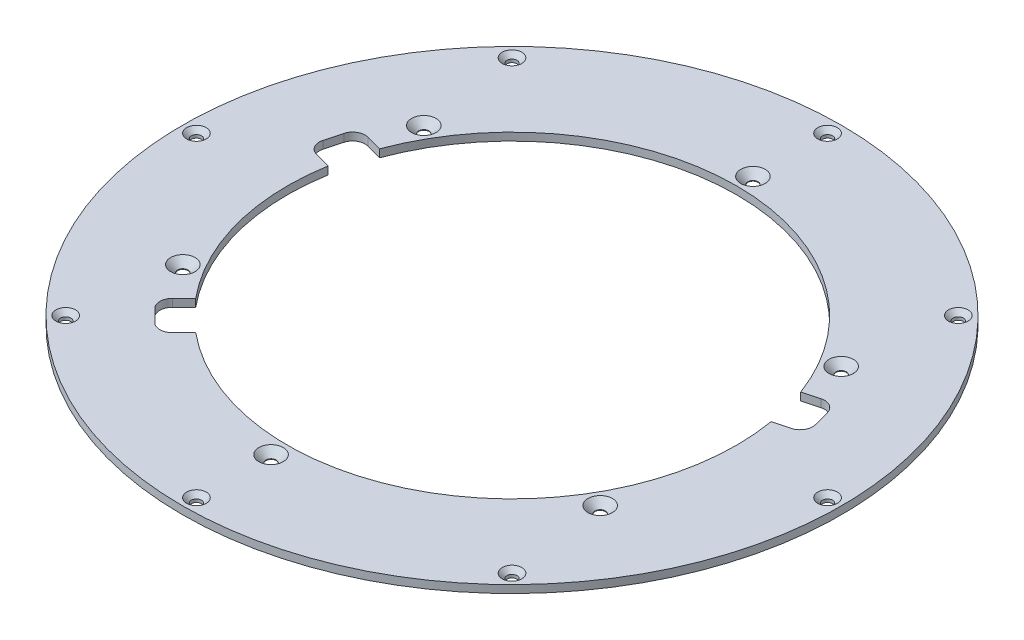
ISO-10303-21;
HEADER;
FILE_DESCRIPTION(('STEP AP214'),'2;1');
FILE_NAME('part.step','',(''),(''),'','','');
FILE_SCHEMA(('AUTOMOTIVE_DESIGN { 1 0 10303 214 1 1 1 1 }'));
ENDSEC;
DATA;
#1=APPLICATION_CONTEXT('core data for automotive mechanical design processes');
#2=APPLICATION_PROTOCOL_DEFINITION('international standard','automotive_design',2000,#1);
#3=PRODUCT_CONTEXT('',#1,'mechanical');
#4=PRODUCT('Part','Part','',(#3));
#5=PRODUCT_RELATED_PRODUCT_CATEGORY('part','',(#4));
#6=PRODUCT_DEFINITION_FORMATION('','',#4);
#7=PRODUCT_DEFINITION_CONTEXT('part definition',#1,'design');
#8=PRODUCT_DEFINITION('design','',#6,#7);
#9=PRODUCT_DEFINITION_SHAPE('','',#8);
#10=(LENGTH_UNIT() NAMED_UNIT(*) SI_UNIT(.MILLI.,.METRE.));
#11=(NAMED_UNIT(*) PLANE_ANGLE_UNIT() SI_UNIT($,.RADIAN.));
#12=(NAMED_UNIT(*) SI_UNIT($,.STERADIAN.) SOLID_ANGLE_UNIT());
#13=UNCERTAINTY_MEASURE_WITH_UNIT(LENGTH_MEASURE(1.E-05),#10,'distance_accuracy_value','');
#14=(GEOMETRIC_REPRESENTATION_CONTEXT(3) GLOBAL_UNCERTAINTY_ASSIGNED_CONTEXT((#13)) GLOBAL_UNIT_ASSIGNED_CONTEXT((#10,
#11,#12)) REPRESENTATION_CONTEXT('',''));
#15=CARTESIAN_POINT('',(0.,0.,0.));
#16=DIRECTION('',(0.,0.,1.));
#17=DIRECTION('',(1.,0.,0.));
#18=AXIS2_PLACEMENT_3D('',#15,#16,#17);
#19=CARTESIAN_POINT('',(0.,3.175,0.));
#20=DIRECTION('',(0.,-1.,0.));
#21=DIRECTION('',(0.,0.,-1.));
#22=AXIS2_PLACEMENT_3D('',#19,#20,#21);
#23=CYLINDRICAL_SURFACE('',#22,91.7575);
#24=DIRECTION('',(0.,-1.,0.));
#25=VECTOR('',#24,1.);
#26=CARTESIAN_POINT('',(-90.4620168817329,3.175,-15.3643193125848));
#27=LINE('',#26,#25);
#28=CARTESIAN_POINT('',(-90.4620168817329,3.175,-15.3643193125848));
#29=VERTEX_POINT('',#28);
#30=CARTESIAN_POINT('',(-90.4620168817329,0.,-15.3643193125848));
#31=VERTEX_POINT('',#30);
#32=EDGE_CURVE('E11',#29,#31,#27,.T.);
#33=ORIENTED_EDGE('',*,*,#32,.F.);
#34=CARTESIAN_POINT('',(0.,3.175,0.));
#35=DIRECTION('',(0.,1.,0.));
#36=DIRECTION('',(0.,0.,1.));
#37=AXIS2_PLACEMENT_3D('',#34,#35,#36);
#38=CIRCLE('',#37,91.7575);
#39=CARTESIAN_POINT('',(-70.6602450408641,3.175,58.5368992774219));
#40=VERTEX_POINT('',#39);
#41=EDGE_CURVE('E413',#29,#40,#38,.T.);
#42=ORIENTED_EDGE('',*,*,#41,.T.);
#43=DIRECTION('',(0.,-1.,0.));
#44=VECTOR('',#43,1.);
#45=CARTESIAN_POINT('',(-70.6602450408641,3.175,58.5368992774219));
#46=LINE('',#45,#44);
#47=CARTESIAN_POINT('',(-70.6602450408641,0.,58.536899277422));
#48=VERTEX_POINT('',#47);
#49=EDGE_CURVE('E428',#48,#40,#46,.F.);
#50=ORIENTED_EDGE('',*,*,#49,.F.);
#51=CARTESIAN_POINT('',(0.,0.,0.));
#52=DIRECTION('',(0.,1.,0.));
#53=DIRECTION('',(0.,0.,1.));
#54=AXIS2_PLACEMENT_3D('',#51,#52,#53);
#55=CIRCLE('',#54,91.7575);
#56=EDGE_CURVE('E187',#31,#48,#55,.T.);
#57=ORIENTED_EDGE('',*,*,#56,.F.);
#58=EDGE_LOOP('',(#33,#42,#50,#57));
#59=FACE_BOUND('',#58,.T.);
#60=ADVANCED_FACE('F41',(#59),#23,.F.);
#61=DIRECTION('',(0.,-1.,0.));
#62=VECTOR('',#61,1.);
#63=CARTESIAN_POINT('',(-58.5368992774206,3.175,70.6602450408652));
#64=LINE('',#63,#62);
#65=CARTESIAN_POINT('',(-58.5368992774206,3.175,70.6602450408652));
#66=VERTEX_POINT('',#65);
#67=CARTESIAN_POINT('',(-58.5368992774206,0.,70.6602450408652));
#68=VERTEX_POINT('',#67);
#69=EDGE_CURVE('E430',#66,#68,#64,.T.);
#70=ORIENTED_EDGE('',*,*,#69,.F.);
#71=CARTESIAN_POINT('',(90.4620168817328,3.175,-15.3643193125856));
#72=VERTEX_POINT('',#71);
#73=EDGE_CURVE('E414',#66,#72,#38,.T.);
#74=ORIENTED_EDGE('',*,*,#73,.T.);
#75=DIRECTION('',(0.,-1.,0.));
#76=VECTOR('',#75,1.);
#77=CARTESIAN_POINT('',(90.4620168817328,3.175,-15.3643193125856));
#78=LINE('',#77,#76);
#79=CARTESIAN_POINT('',(90.4620168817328,0.,-15.3643193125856));
#80=VERTEX_POINT('',#79);
#81=EDGE_CURVE('E421',#80,#72,#78,.F.);
#82=ORIENTED_EDGE('',*,*,#81,.F.);
#83=EDGE_CURVE('E408',#68,#80,#55,.T.);
#84=ORIENTED_EDGE('',*,*,#83,.F.);
#85=EDGE_LOOP('',(#70,#74,#82,#84));
#86=FACE_BOUND('',#85,.T.);
#87=ADVANCED_FACE('F485',(#86),#23,.F.);
#88=CARTESIAN_POINT('',(0.,3.175,0.));
#89=DIRECTION('',(0.,1.,0.));
#90=DIRECTION('',(0.,0.,1.));
#91=AXIS2_PLACEMENT_3D('',#88,#89,#90);
#92=PLANE('',#91);
#93=DIRECTION('',(0.96592582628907,0.,0.258819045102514));
#94=VECTOR('',#93,1.);
#95=CARTESIAN_POINT('',(-2.21872626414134,3.175,8.28039914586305));
#96=LINE('',#95,#94);
#97=CARTESIAN_POINT('',(-96.9832942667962,3.175,-17.1116903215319));
#98=VERTEX_POINT('',#97);
#99=EDGE_CURVE('E215',#98,#29,#96,.T.);
#100=ORIENTED_EDGE('',*,*,#99,.F.);
#101=CARTESIAN_POINT('',(-95.6684935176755,3.175,-22.0185935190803));
#102=DIRECTION('',(0.,1.,0.));
#103=DIRECTION('',(-0.499999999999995,0.,0.866025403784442));
#104=AXIS2_PLACEMENT_3D('',#101,#102,#103);
#105=CIRCLE('',#104,5.08);
#106=CARTESIAN_POINT('',(-100.575396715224,3.175,-23.3333942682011));
#107=VERTEX_POINT('',#106);
#108=EDGE_CURVE('E233',#107,#98,#105,.T.);
#109=ORIENTED_EDGE('',*,*,#108,.F.);
#110=DIRECTION('',(-0.258819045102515,0.,0.96592582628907));
#111=VECTOR('',#110,1.);
#112=CARTESIAN_POINT('',(-100.575396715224,3.175,-23.3333942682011));
#113=LINE('',#112,#111);
#114=CARTESIAN_POINT('',(-98.7675456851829,3.175,-30.0803861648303));
#115=VERTEX_POINT('',#114);
#116=EDGE_CURVE('E230',#115,#107,#113,.T.);
#117=ORIENTED_EDGE('',*,*,#116,.F.);
#118=CARTESIAN_POINT('',(-93.8606424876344,3.175,-28.7655854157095));
#119=DIRECTION('',(0.,1.,0.));
#120=DIRECTION('',(0.499999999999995,0.,-0.866025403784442));
#121=AXIS2_PLACEMENT_3D('',#118,#119,#120);
#122=CIRCLE('',#121,5.08);
#123=CARTESIAN_POINT('',(-92.5458417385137,3.175,-33.672488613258));
#124=VERTEX_POINT('',#123);
#125=EDGE_CURVE('E227',#124,#115,#122,.T.);
#126=ORIENTED_EDGE('',*,*,#125,.F.);
#127=DIRECTION('',(-0.96592582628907,0.,-0.258819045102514));
#128=VECTOR('',#127,1.);
#129=CARTESIAN_POINT('',(2.21872626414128,3.175,-8.28039914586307));
#130=LINE('',#129,#128);
#131=CARTESIAN_POINT('',(-86.0245643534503,3.175,-31.9251176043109));
#132=VERTEX_POINT('',#131);
#133=EDGE_CURVE('E209',#132,#124,#130,.T.);
#134=ORIENTED_EDGE('',*,*,#133,.F.);
#135=CARTESIAN_POINT('',(86.0245643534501,3.175,-31.9251176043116));
#136=VERTEX_POINT('',#135);
#137=EDGE_CURVE('E409',#136,#132,#38,.T.);
#138=ORIENTED_EDGE('',*,*,#137,.F.);
#139=DIRECTION('',(-0.965925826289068,0.,0.258819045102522));
#140=VECTOR('',#139,1.);
#141=CARTESIAN_POINT('',(-2.21872626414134,3.175,-8.28039914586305));
#142=LINE('',#141,#140);
#143=CARTESIAN_POINT('',(92.5458417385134,3.175,-33.6724886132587));
#144=VERTEX_POINT('',#143);
#145=EDGE_CURVE('E250',#144,#136,#142,.T.);
#146=ORIENTED_EDGE('',*,*,#145,.F.);
#147=CARTESIAN_POINT('',(93.8606424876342,3.175,-28.7655854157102));
#148=DIRECTION('',(0.,1.,0.));
#149=DIRECTION('',(0.,0.,-1.));
#150=AXIS2_PLACEMENT_3D('',#147,#148,#149);
#151=CIRCLE('',#150,5.08);
#152=CARTESIAN_POINT('',(98.7675456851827,3.175,-30.080386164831));
#153=VERTEX_POINT('',#152);
#154=EDGE_CURVE('E270',#153,#144,#151,.T.);
#155=ORIENTED_EDGE('',*,*,#154,.F.);
#156=DIRECTION('',(-0.258819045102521,0.,-0.965925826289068));
#157=VECTOR('',#156,1.);
#158=CARTESIAN_POINT('',(98.7675456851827,3.175,-30.080386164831));
#159=LINE('',#158,#157);
#160=CARTESIAN_POINT('',(100.575396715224,3.175,-23.3333942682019));
#161=VERTEX_POINT('',#160);
#162=EDGE_CURVE('E267',#161,#153,#159,.T.);
#163=ORIENTED_EDGE('',*,*,#162,.F.);
#164=CARTESIAN_POINT('',(95.6684935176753,3.175,-22.0185935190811));
#165=DIRECTION('',(0.,1.,0.));
#166=DIRECTION('',(0.,0.,1.));
#167=AXIS2_PLACEMENT_3D('',#164,#165,#166);
#168=CIRCLE('',#167,5.08);
#169=CARTESIAN_POINT('',(96.9832942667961,3.175,-17.1116903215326));
#170=VERTEX_POINT('',#169);
#171=EDGE_CURVE('E264',#170,#161,#168,.T.);
#172=ORIENTED_EDGE('',*,*,#171,.F.);
#173=DIRECTION('',(0.965925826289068,0.,-0.258819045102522));
#174=VECTOR('',#173,1.);
#175=CARTESIAN_POINT('',(2.2187262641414,3.175,8.28039914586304));
#176=LINE('',#175,#174);
#177=EDGE_CURVE('E239',#72,#170,#176,.T.);
#178=ORIENTED_EDGE('',*,*,#177,.F.);
#179=ORIENTED_EDGE('',*,*,#73,.F.);
#180=DIRECTION('',(0.707106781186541,0.,-0.707106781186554));
#181=VECTOR('',#180,1.);
#182=CARTESIAN_POINT('',(6.06167288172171,3.175,6.06167288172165));
#183=LINE('',#182,#181);
#184=CARTESIAN_POINT('',(-63.3108056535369,3.175,75.4341514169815));
#185=VERTEX_POINT('',#184);
#186=EDGE_CURVE('E188',#185,#66,#183,.T.);
#187=ORIENTED_EDGE('',*,*,#186,.F.);
#188=CARTESIAN_POINT('',(-66.9029081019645,3.175,71.8420489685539));
#189=DIRECTION('',(0.,1.,0.));
#190=DIRECTION('',(0.500000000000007,0.,0.866025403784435));
#191=AXIS2_PLACEMENT_3D('',#188,#189,#190);
#192=CIRCLE('',#191,5.08);
#193=CARTESIAN_POINT('',(-70.4950105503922,3.175,75.4341514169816));
#194=VERTEX_POINT('',#193);
#195=EDGE_CURVE('E190',#194,#185,#192,.T.);
#196=ORIENTED_EDGE('',*,*,#195,.F.);
#197=DIRECTION('',(0.707106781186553,0.,0.707106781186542));
#198=VECTOR('',#197,1.);
#199=CARTESIAN_POINT('',(-70.4950105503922,3.175,75.4341514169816));
#200=LINE('',#199,#198);
#201=CARTESIAN_POINT('',(-75.4341514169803,3.175,70.4950105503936));
#202=VERTEX_POINT('',#201);
#203=EDGE_CURVE('E202',#202,#194,#200,.T.);
#204=ORIENTED_EDGE('',*,*,#203,.F.);
#205=CARTESIAN_POINT('',(-71.8420489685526,3.175,66.9029081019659));
#206=DIRECTION('',(0.,1.,0.));
#207=DIRECTION('',(-0.500000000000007,0.,-0.866025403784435));
#208=AXIS2_PLACEMENT_3D('',#205,#206,#207);
#209=CIRCLE('',#208,5.08);
#210=CARTESIAN_POINT('',(-75.4341514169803,3.175,63.3108056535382));
#211=VERTEX_POINT('',#210);
#212=EDGE_CURVE('E200',#211,#202,#209,.T.);
#213=ORIENTED_EDGE('',*,*,#212,.F.);
#214=DIRECTION('',(-0.707106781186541,0.,0.707106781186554));
#215=VECTOR('',#214,1.);
#216=CARTESIAN_POINT('',(-6.06167288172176,3.175,-6.06167288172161));
#217=LINE('',#216,#215);
#218=EDGE_CURVE('E167',#40,#211,#217,.T.);
#219=ORIENTED_EDGE('',*,*,#218,.F.);
#220=ORIENTED_EDGE('',*,*,#41,.F.);
#221=EDGE_LOOP('',(#100,#109,#117,#126,#134,#138,#146,#155,#163,#172,#178,#179,#187,#196,#204,
#213,#219,#220));
#222=FACE_BOUND('',#221,.T.);
#223=CARTESIAN_POINT('',(85.2385503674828,3.175,-49.212500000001));
#224=DIRECTION('',(0.,1.,0.));
#225=DIRECTION('',(-0.866025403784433,0.,0.50000000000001));
#226=AXIS2_PLACEMENT_3D('',#223,#224,#225);
#227=CIRCLE('',#226,5.0038);
#228=CARTESIAN_POINT('',(80.9051324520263,3.175,-46.7106000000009));
#229=VERTEX_POINT('',#228);
#230=EDGE_CURVE('E276',#229,#229,#227,.T.);
#231=ORIENTED_EDGE('',*,*,#230,.F.);
#232=EDGE_LOOP('',(#231));
#233=FACE_BOUND('',#232,.T.);
#234=CARTESIAN_POINT('',(85.2385503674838,3.175,49.2124999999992));
#235=DIRECTION('',(0.,1.,0.));
#236=DIRECTION('',(-0.866025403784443,0.,-0.499999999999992));
#237=AXIS2_PLACEMENT_3D('',#234,#235,#236);
#238=CIRCLE('',#237,5.0038);
#239=CARTESIAN_POINT('',(80.9051324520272,3.175,46.7105999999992));
#240=VERTEX_POINT('',#239);
#241=EDGE_CURVE('E303',#240,#240,#238,.T.);
#242=ORIENTED_EDGE('',*,*,#241,.F.);
#243=EDGE_LOOP('',(#242));
#244=FACE_BOUND('',#243,.T.);
#245=CARTESIAN_POINT('',(0.,3.175,98.425));
#246=DIRECTION('',(0.,1.,0.));
#247=DIRECTION('',(0.,0.,-1.));
#248=AXIS2_PLACEMENT_3D('',#245,#246,#247);
#249=CIRCLE('',#248,5.0038);
#250=CARTESIAN_POINT('',(0.,3.175,93.4212));
#251=VERTEX_POINT('',#250);
#252=EDGE_CURVE('E294',#251,#251,#249,.T.);
#253=ORIENTED_EDGE('',*,*,#252,.F.);
#254=EDGE_LOOP('',(#253));
#255=FACE_BOUND('',#254,.T.);
#256=CARTESIAN_POINT('',(-85.2385503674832,3.175,49.2125000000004));
#257=DIRECTION('',(0.,1.,0.));
#258=DIRECTION('',(0.866025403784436,0.,-0.500000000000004));
#259=AXIS2_PLACEMENT_3D('',#256,#257,#258);
#260=CIRCLE('',#259,5.0038);
#261=CARTESIAN_POINT('',(-80.9051324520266,3.175,46.7106000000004));
#262=VERTEX_POINT('',#261);
#263=EDGE_CURVE('E283',#262,#262,#260,.T.);
#264=ORIENTED_EDGE('',*,*,#263,.F.);
#265=EDGE_LOOP('',(#264));
#266=FACE_BOUND('',#265,.T.);
#267=CARTESIAN_POINT('',(-85.2385503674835,3.175,-49.2124999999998));
#268=DIRECTION('',(0.,1.,0.));
#269=DIRECTION('',(0.86602540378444,0.,0.499999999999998));
#270=AXIS2_PLACEMENT_3D('',#267,#268,#269);
#271=CIRCLE('',#270,5.0038);
#272=CARTESIAN_POINT('',(-80.9051324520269,3.175,-46.7105999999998));
#273=VERTEX_POINT('',#272);
#274=EDGE_CURVE('E293',#273,#273,#271,.T.);
#275=ORIENTED_EDGE('',*,*,#274,.F.);
#276=EDGE_LOOP('',(#275));
#277=FACE_BOUND('',#276,.T.);
#278=CARTESIAN_POINT('',(0.,3.175,-98.425));
#279=DIRECTION('',(0.,1.,0.));
#280=DIRECTION('',(0.,0.,1.));
#281=AXIS2_PLACEMENT_3D('',#278,#279,#280);
#282=CIRCLE('',#281,5.0038);
#283=CARTESIAN_POINT('',(0.,3.175,-93.4212));
#284=VERTEX_POINT('',#283);
#285=EDGE_CURVE('E327',#284,#284,#282,.T.);
#286=ORIENTED_EDGE('',*,*,#285,.F.);
#287=EDGE_LOOP('',(#286));
#288=FACE_BOUND('',#287,.T.);
#289=CARTESIAN_POINT('',(91.1495996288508,3.175,-91.149599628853));
#290=DIRECTION('',(0.,1.,0.));
#291=DIRECTION('',(0.,0.,1.));
#292=AXIS2_PLACEMENT_3D('',#289,#290,#291);
#293=CIRCLE('',#292,4.0005);
#294=CARTESIAN_POINT('',(91.1495996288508,3.175,-87.149099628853));
#295=VERTEX_POINT('',#294);
#296=EDGE_CURVE('E336',#295,#295,#293,.T.);
#297=ORIENTED_EDGE('',*,*,#296,.F.);
#298=EDGE_LOOP('',(#297));
#299=FACE_BOUND('',#298,.T.);
#300=CARTESIAN_POINT('',(128.905,3.175,-1.35020820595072E-12));
#301=DIRECTION('',(0.,1.,0.));
#302=DIRECTION('',(0.,0.,1.));
#303=AXIS2_PLACEMENT_3D('',#300,#301,#302);
#304=CIRCLE('',#303,4.00049999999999);
#305=CARTESIAN_POINT('',(128.905,3.175,4.00049999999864));
#306=VERTEX_POINT('',#305);
#307=EDGE_CURVE('E345',#306,#306,#304,.T.);
#308=ORIENTED_EDGE('',*,*,#307,.F.);
#309=EDGE_LOOP('',(#308));
#310=FACE_BOUND('',#309,.T.);
#311=CARTESIAN_POINT('',(91.1495996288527,3.175,91.1495996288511));
#312=DIRECTION('',(0.,1.,0.));
#313=DIRECTION('',(0.,0.,1.));
#314=AXIS2_PLACEMENT_3D('',#311,#312,#313);
#315=CIRCLE('',#314,4.0005);
#316=CARTESIAN_POINT('',(91.1495996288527,3.175,95.1500996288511));
#317=VERTEX_POINT('',#316);
#318=EDGE_CURVE('E354',#317,#317,#315,.T.);
#319=ORIENTED_EDGE('',*,*,#318,.F.);
#320=EDGE_LOOP('',(#319));
#321=FACE_BOUND('',#320,.T.);
#322=CARTESIAN_POINT('',(0.,3.175,128.905));
#323=DIRECTION('',(0.,1.,0.));
#324=DIRECTION('',(0.,0.,1.));
#325=AXIS2_PLACEMENT_3D('',#322,#323,#324);
#326=CIRCLE('',#325,4.0005);
#327=CARTESIAN_POINT('',(0.,3.175,132.9055));
#328=VERTEX_POINT('',#327);
#329=EDGE_CURVE('E363',#328,#328,#326,.T.);
#330=ORIENTED_EDGE('',*,*,#329,.F.);
#331=EDGE_LOOP('',(#330));
#332=FACE_BOUND('',#331,.T.);
#333=CARTESIAN_POINT('',(-91.1495996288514,3.175,91.1495996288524));
#334=DIRECTION('',(0.,1.,0.));
#335=DIRECTION('',(0.,0.,1.));
#336=AXIS2_PLACEMENT_3D('',#333,#334,#335);
#337=CIRCLE('',#336,4.0005);
#338=CARTESIAN_POINT('',(-91.1495996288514,3.175,95.1500996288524));
#339=VERTEX_POINT('',#338);
#340=EDGE_CURVE('E372',#339,#339,#337,.T.);
#341=ORIENTED_EDGE('',*,*,#340,.F.);
#342=EDGE_LOOP('',(#341));
#343=FACE_BOUND('',#342,.T.);
#344=CARTESIAN_POINT('',(-128.905,3.175,4.50069401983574E-13));
#345=DIRECTION('',(0.,1.,0.));
#346=DIRECTION('',(0.,0.,1.));
#347=AXIS2_PLACEMENT_3D('',#344,#345,#346);
#348=CIRCLE('',#347,4.0005);
#349=CARTESIAN_POINT('',(-128.905,3.175,4.00050000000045));
#350=VERTEX_POINT('',#349);
#351=EDGE_CURVE('E381',#350,#350,#348,.T.);
#352=ORIENTED_EDGE('',*,*,#351,.F.);
#353=EDGE_LOOP('',(#352));
#354=FACE_BOUND('',#353,.T.);
#355=CARTESIAN_POINT('',(-91.1495996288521,3.175,-91.1495996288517));
#356=DIRECTION('',(0.,1.,0.));
#357=DIRECTION('',(0.,0.,1.));
#358=AXIS2_PLACEMENT_3D('',#355,#356,#357);
#359=CIRCLE('',#358,4.0005);
#360=CARTESIAN_POINT('',(-91.1495996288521,3.175,-87.1490996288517));
#361=VERTEX_POINT('',#360);
#362=EDGE_CURVE('E390',#361,#361,#359,.T.);
#363=ORIENTED_EDGE('',*,*,#362,.F.);
#364=EDGE_LOOP('',(#363));
#365=FACE_BOUND('',#364,.T.);
#366=CARTESIAN_POINT('',(0.,3.175,-128.905));
#367=DIRECTION('',(0.,1.,0.));
#368=DIRECTION('',(0.,0.,1.));
#369=AXIS2_PLACEMENT_3D('',#366,#367,#368);
#370=CIRCLE('',#369,4.0005);
#371=CARTESIAN_POINT('',(0.,3.175,-124.9045));
#372=VERTEX_POINT('',#371);
#373=EDGE_CURVE('E399',#372,#372,#370,.T.);
#374=ORIENTED_EDGE('',*,*,#373,.F.);
#375=EDGE_LOOP('',(#374));
#376=FACE_BOUND('',#375,.T.);
#377=CARTESIAN_POINT('',(0.,3.175,0.));
#378=DIRECTION('',(0.,1.,0.));
#379=DIRECTION('',(0.,0.,1.));
#380=AXIS2_PLACEMENT_3D('',#377,#378,#379);
#381=CIRCLE('',#380,134.62);
#382=CARTESIAN_POINT('',(0.,3.175,134.62));
#383=VERTEX_POINT('',#382);
#384=EDGE_CURVE('E418',#383,#383,#381,.T.);
#385=ORIENTED_EDGE('',*,*,#384,.T.);
#386=EDGE_LOOP('',(#385));
#387=FACE_BOUND('',#386,.T.);
#388=ADVANCED_FACE('F439',(#222,#233,#244,#255,#266,#277,#288,#299,#310,#321,#332,#343,#354,
#365,#376,#387),#92,.T.);
#389=CARTESIAN_POINT('',(0.,0.,0.));
#390=DIRECTION('',(0.,1.,0.));
#391=DIRECTION('',(0.,0.,1.));
#392=AXIS2_PLACEMENT_3D('',#389,#390,#391);
#393=PLANE('',#392);
#394=CARTESIAN_POINT('',(85.2385503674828,0.,-49.212500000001));
#395=DIRECTION('',(0.,1.,0.));
#396=DIRECTION('',(-0.866025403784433,0.,0.50000000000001));
#397=AXIS2_PLACEMENT_3D('',#394,#395,#396);
#398=CIRCLE('',#397,2.08279999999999);
#399=CARTESIAN_POINT('',(83.4347926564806,0.,-48.171100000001));
#400=VERTEX_POINT('',#399);
#401=EDGE_CURVE('E314',#400,#400,#398,.T.);
#402=ORIENTED_EDGE('',*,*,#401,.T.);
#403=EDGE_LOOP('',(#402));
#404=FACE_BOUND('',#403,.T.);
#405=CARTESIAN_POINT('',(85.2385503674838,0.,49.2124999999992));
#406=DIRECTION('',(0.,1.,0.));
#407=DIRECTION('',(-0.866025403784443,0.,-0.499999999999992));
#408=AXIS2_PLACEMENT_3D('',#405,#406,#407);
#409=CIRCLE('',#408,2.08279999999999);
#410=CARTESIAN_POINT('',(83.4347926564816,0.,48.1710999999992));
#411=VERTEX_POINT('',#410);
#412=EDGE_CURVE('E306',#411,#411,#409,.T.);
#413=ORIENTED_EDGE('',*,*,#412,.T.);
#414=EDGE_LOOP('',(#413));
#415=FACE_BOUND('',#414,.T.);
#416=CARTESIAN_POINT('',(0.,0.,98.425));
#417=DIRECTION('',(0.,1.,0.));
#418=DIRECTION('',(0.,0.,-1.));
#419=AXIS2_PLACEMENT_3D('',#416,#417,#418);
#420=CIRCLE('',#419,2.08279999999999);
#421=CARTESIAN_POINT('',(0.,0.,96.3422));
#422=VERTEX_POINT('',#421);
#423=EDGE_CURVE('E297',#422,#422,#420,.T.);
#424=ORIENTED_EDGE('',*,*,#423,.T.);
#425=EDGE_LOOP('',(#424));
#426=FACE_BOUND('',#425,.T.);
#427=CARTESIAN_POINT('',(-85.2385503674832,0.,49.2125000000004));
#428=DIRECTION('',(0.,1.,0.));
#429=DIRECTION('',(0.866025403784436,0.,-0.500000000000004));
#430=AXIS2_PLACEMENT_3D('',#427,#428,#429);
#431=CIRCLE('',#430,2.08279999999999);
#432=CARTESIAN_POINT('',(-83.434792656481,0.,48.1711000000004));
#433=VERTEX_POINT('',#432);
#434=EDGE_CURVE('E286',#433,#433,#431,.T.);
#435=ORIENTED_EDGE('',*,*,#434,.T.);
#436=EDGE_LOOP('',(#435));
#437=FACE_BOUND('',#436,.T.);
#438=CARTESIAN_POINT('',(-85.2385503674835,0.,-49.2124999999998));
#439=DIRECTION('',(0.,1.,0.));
#440=DIRECTION('',(0.86602540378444,0.,0.499999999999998));
#441=AXIS2_PLACEMENT_3D('',#438,#439,#440);
#442=CIRCLE('',#441,2.08279999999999);
#443=CARTESIAN_POINT('',(-83.4347926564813,0.,-48.1710999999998));
#444=VERTEX_POINT('',#443);
#445=EDGE_CURVE('E321',#444,#444,#442,.T.);
#446=ORIENTED_EDGE('',*,*,#445,.T.);
#447=EDGE_LOOP('',(#446));
#448=FACE_BOUND('',#447,.T.);
#449=CARTESIAN_POINT('',(0.,0.,-98.425));
#450=DIRECTION('',(0.,1.,0.));
#451=DIRECTION('',(0.,0.,1.));
#452=AXIS2_PLACEMENT_3D('',#449,#450,#451);
#453=CIRCLE('',#452,2.08279999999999);
#454=CARTESIAN_POINT('',(0.,0.,-96.3422));
#455=VERTEX_POINT('',#454);
#456=EDGE_CURVE('E333',#455,#455,#453,.T.);
#457=ORIENTED_EDGE('',*,*,#456,.T.);
#458=EDGE_LOOP('',(#457));
#459=FACE_BOUND('',#458,.T.);
#460=CARTESIAN_POINT('',(91.1495996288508,0.,-91.149599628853));
#461=DIRECTION('',(0.,1.,0.));
#462=DIRECTION('',(0.,0.,1.));
#463=AXIS2_PLACEMENT_3D('',#460,#461,#462);
#464=CIRCLE('',#463,2.0828);
#465=CARTESIAN_POINT('',(91.1495996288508,0.,-89.066799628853));
#466=VERTEX_POINT('',#465);
#467=EDGE_CURVE('E342',#466,#466,#464,.T.);
#468=ORIENTED_EDGE('',*,*,#467,.T.);
#469=EDGE_LOOP('',(#468));
#470=FACE_BOUND('',#469,.T.);
#471=CARTESIAN_POINT('',(128.905,0.,-1.35020820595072E-12));
#472=DIRECTION('',(0.,1.,0.));
#473=DIRECTION('',(0.,0.,1.));
#474=AXIS2_PLACEMENT_3D('',#471,#472,#473);
#475=CIRCLE('',#474,2.0828);
#476=CARTESIAN_POINT('',(128.905,0.,2.08279999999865));
#477=VERTEX_POINT('',#476);
#478=EDGE_CURVE('E351',#477,#477,#475,.T.);
#479=ORIENTED_EDGE('',*,*,#478,.T.);
#480=EDGE_LOOP('',(#479));
#481=FACE_BOUND('',#480,.T.);
#482=CARTESIAN_POINT('',(91.1495996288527,0.,91.1495996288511));
#483=DIRECTION('',(0.,1.,0.));
#484=DIRECTION('',(0.,0.,1.));
#485=AXIS2_PLACEMENT_3D('',#482,#483,#484);
#486=CIRCLE('',#485,2.0828);
#487=CARTESIAN_POINT('',(91.1495996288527,0.,93.2323996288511));
#488=VERTEX_POINT('',#487);
#489=EDGE_CURVE('E360',#488,#488,#486,.T.);
#490=ORIENTED_EDGE('',*,*,#489,.T.);
#491=EDGE_LOOP('',(#490));
#492=FACE_BOUND('',#491,.T.);
#493=CARTESIAN_POINT('',(0.,0.,128.905));
#494=DIRECTION('',(0.,1.,0.));
#495=DIRECTION('',(0.,0.,1.));
#496=AXIS2_PLACEMENT_3D('',#493,#494,#495);
#497=CIRCLE('',#496,2.0828);
#498=CARTESIAN_POINT('',(0.,0.,130.9878));
#499=VERTEX_POINT('',#498);
#500=EDGE_CURVE('E369',#499,#499,#497,.T.);
#501=ORIENTED_EDGE('',*,*,#500,.T.);
#502=EDGE_LOOP('',(#501));
#503=FACE_BOUND('',#502,.T.);
#504=CARTESIAN_POINT('',(-91.1495996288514,0.,91.1495996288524));
#505=DIRECTION('',(0.,1.,0.));
#506=DIRECTION('',(0.,0.,1.));
#507=AXIS2_PLACEMENT_3D('',#504,#505,#506);
#508=CIRCLE('',#507,2.0828);
#509=CARTESIAN_POINT('',(-91.1495996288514,0.,93.2323996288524));
#510=VERTEX_POINT('',#509);
#511=EDGE_CURVE('E378',#510,#510,#508,.T.);
#512=ORIENTED_EDGE('',*,*,#511,.T.);
#513=EDGE_LOOP('',(#512));
#514=FACE_BOUND('',#513,.T.);
#515=CARTESIAN_POINT('',(-128.905,0.,4.50069401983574E-13));
#516=DIRECTION('',(0.,1.,0.));
#517=DIRECTION('',(0.,0.,1.));
#518=AXIS2_PLACEMENT_3D('',#515,#516,#517);
#519=CIRCLE('',#518,2.0828);
#520=CARTESIAN_POINT('',(-128.905,0.,2.08280000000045));
#521=VERTEX_POINT('',#520);
#522=EDGE_CURVE('E387',#521,#521,#519,.T.);
#523=ORIENTED_EDGE('',*,*,#522,.T.);
#524=EDGE_LOOP('',(#523));
#525=FACE_BOUND('',#524,.T.);
#526=CARTESIAN_POINT('',(-91.1495996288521,0.,-91.1495996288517));
#527=DIRECTION('',(0.,1.,0.));
#528=DIRECTION('',(0.,0.,1.));
#529=AXIS2_PLACEMENT_3D('',#526,#527,#528);
#530=CIRCLE('',#529,2.0828);
#531=CARTESIAN_POINT('',(-91.1495996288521,0.,-89.0667996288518));
#532=VERTEX_POINT('',#531);
#533=EDGE_CURVE('E396',#532,#532,#530,.T.);
#534=ORIENTED_EDGE('',*,*,#533,.T.);
#535=EDGE_LOOP('',(#534));
#536=FACE_BOUND('',#535,.T.);
#537=CARTESIAN_POINT('',(0.,0.,-128.905));
#538=DIRECTION('',(0.,1.,0.));
#539=DIRECTION('',(0.,0.,1.));
#540=AXIS2_PLACEMENT_3D('',#537,#538,#539);
#541=CIRCLE('',#540,2.0828);
#542=CARTESIAN_POINT('',(0.,0.,-126.8222));
#543=VERTEX_POINT('',#542);
#544=EDGE_CURVE('E405',#543,#543,#541,.T.);
#545=ORIENTED_EDGE('',*,*,#544,.T.);
#546=EDGE_LOOP('',(#545));
#547=FACE_BOUND('',#546,.T.);
#548=CARTESIAN_POINT('',(0.,0.,0.));
#549=DIRECTION('',(0.,1.,0.));
#550=DIRECTION('',(0.,0.,1.));
#551=AXIS2_PLACEMENT_3D('',#548,#549,#550);
#552=CIRCLE('',#551,134.62);
#553=CARTESIAN_POINT('',(0.,0.,134.62));
#554=VERTEX_POINT('',#553);
#555=EDGE_CURVE('E412',#554,#554,#552,.T.);
#556=ORIENTED_EDGE('',*,*,#555,.F.);
#557=EDGE_LOOP('',(#556));
#558=FACE_BOUND('',#557,.T.);
#559=CARTESIAN_POINT('',(-95.6684935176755,0.,-22.0185935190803));
#560=DIRECTION('',(0.,1.,0.));
#561=DIRECTION('',(-0.499999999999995,0.,0.866025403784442));
#562=AXIS2_PLACEMENT_3D('',#559,#560,#561);
#563=CIRCLE('',#562,5.08);
#564=CARTESIAN_POINT('',(-100.575396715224,0.,-23.3333942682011));
#565=VERTEX_POINT('',#564);
#566=CARTESIAN_POINT('',(-96.9832942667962,0.,-17.1116903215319));
#567=VERTEX_POINT('',#566);
#568=EDGE_CURVE('E221',#565,#567,#563,.T.);
#569=ORIENTED_EDGE('',*,*,#568,.T.);
#570=DIRECTION('',(0.96592582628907,0.,0.258819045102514));
#571=VECTOR('',#570,1.);
#572=CARTESIAN_POINT('',(-2.21872626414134,0.,8.28039914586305));
#573=LINE('',#572,#571);
#574=EDGE_CURVE('E223',#567,#31,#573,.T.);
#575=ORIENTED_EDGE('',*,*,#574,.T.);
#576=ORIENTED_EDGE('',*,*,#56,.T.);
#577=DIRECTION('',(-0.707106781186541,0.,0.707106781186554));
#578=VECTOR('',#577,1.);
#579=CARTESIAN_POINT('',(-6.06167288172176,0.,-6.06167288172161));
#580=LINE('',#579,#578);
#581=CARTESIAN_POINT('',(-75.4341514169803,0.,63.3108056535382));
#582=VERTEX_POINT('',#581);
#583=EDGE_CURVE('E56',#48,#582,#580,.T.);
#584=ORIENTED_EDGE('',*,*,#583,.T.);
#585=CARTESIAN_POINT('',(-71.8420489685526,0.,66.9029081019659));
#586=DIRECTION('',(0.,1.,0.));
#587=DIRECTION('',(-0.500000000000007,0.,-0.866025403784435));
#588=AXIS2_PLACEMENT_3D('',#585,#586,#587);
#589=CIRCLE('',#588,5.08);
#590=CARTESIAN_POINT('',(-75.4341514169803,0.,70.4950105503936));
#591=VERTEX_POINT('',#590);
#592=EDGE_CURVE('E175',#582,#591,#589,.T.);
#593=ORIENTED_EDGE('',*,*,#592,.T.);
#594=DIRECTION('',(0.707106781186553,0.,0.707106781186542));
#595=VECTOR('',#594,1.);
#596=CARTESIAN_POINT('',(-70.4950105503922,0.,75.4341514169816));
#597=LINE('',#596,#595);
#598=CARTESIAN_POINT('',(-70.4950105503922,0.,75.4341514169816));
#599=VERTEX_POINT('',#598);
#600=EDGE_CURVE('E180',#591,#599,#597,.T.);
#601=ORIENTED_EDGE('',*,*,#600,.T.);
#602=CARTESIAN_POINT('',(-66.9029081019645,0.,71.8420489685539));
#603=DIRECTION('',(0.,1.,0.));
#604=DIRECTION('',(0.500000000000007,0.,0.866025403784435));
#605=AXIS2_PLACEMENT_3D('',#602,#603,#604);
#606=CIRCLE('',#605,5.08);
#607=CARTESIAN_POINT('',(-63.3108056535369,0.,75.4341514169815));
#608=VERTEX_POINT('',#607);
#609=EDGE_CURVE('E194',#599,#608,#606,.T.);
#610=ORIENTED_EDGE('',*,*,#609,.T.);
#611=DIRECTION('',(0.707106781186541,0.,-0.707106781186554));
#612=VECTOR('',#611,1.);
#613=CARTESIAN_POINT('',(6.06167288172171,0.,6.06167288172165));
#614=LINE('',#613,#612);
#615=EDGE_CURVE('E172',#608,#68,#614,.T.);
#616=ORIENTED_EDGE('',*,*,#615,.T.);
#617=ORIENTED_EDGE('',*,*,#83,.T.);
#618=DIRECTION('',(0.965925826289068,0.,-0.258819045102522));
#619=VECTOR('',#618,1.);
#620=CARTESIAN_POINT('',(2.2187262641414,0.,8.28039914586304));
#621=LINE('',#620,#619);
#622=CARTESIAN_POINT('',(96.9832942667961,0.,-17.1116903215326));
#623=VERTEX_POINT('',#622);
#624=EDGE_CURVE('E246',#80,#623,#621,.T.);
#625=ORIENTED_EDGE('',*,*,#624,.T.);
#626=CARTESIAN_POINT('',(95.6684935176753,0.,-22.0185935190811));
#627=DIRECTION('',(0.,1.,0.));
#628=DIRECTION('',(0.,0.,1.));
#629=AXIS2_PLACEMENT_3D('',#626,#627,#628);
#630=CIRCLE('',#629,5.08);
#631=CARTESIAN_POINT('',(100.575396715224,0.,-23.3333942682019));
#632=VERTEX_POINT('',#631);
#633=EDGE_CURVE('E249',#623,#632,#630,.T.);
#634=ORIENTED_EDGE('',*,*,#633,.T.);
#635=DIRECTION('',(-0.258819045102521,0.,-0.965925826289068));
#636=VECTOR('',#635,1.);
#637=CARTESIAN_POINT('',(98.7675456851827,0.,-30.080386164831));
#638=LINE('',#637,#636);
#639=CARTESIAN_POINT('',(98.7675456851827,0.,-30.080386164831));
#640=VERTEX_POINT('',#639);
#641=EDGE_CURVE('E253',#632,#640,#638,.T.);
#642=ORIENTED_EDGE('',*,*,#641,.T.);
#643=CARTESIAN_POINT('',(93.8606424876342,0.,-28.7655854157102));
#644=DIRECTION('',(0.,1.,0.));
#645=DIRECTION('',(0.,0.,-1.));
#646=AXIS2_PLACEMENT_3D('',#643,#644,#645);
#647=CIRCLE('',#646,5.08);
#648=CARTESIAN_POINT('',(92.5458417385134,0.,-33.6724886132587));
#649=VERTEX_POINT('',#648);
#650=EDGE_CURVE('E256',#640,#649,#647,.T.);
#651=ORIENTED_EDGE('',*,*,#650,.T.);
#652=DIRECTION('',(-0.965925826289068,0.,0.258819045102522));
#653=VECTOR('',#652,1.);
#654=CARTESIAN_POINT('',(-2.21872626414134,0.,-8.28039914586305));
#655=LINE('',#654,#653);
#656=CARTESIAN_POINT('',(86.0245643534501,0.,-31.9251176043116));
#657=VERTEX_POINT('',#656);
#658=EDGE_CURVE('E259',#649,#657,#655,.T.);
#659=ORIENTED_EDGE('',*,*,#658,.T.);
#660=CARTESIAN_POINT('',(-86.0245643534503,0.,-31.9251176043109));
#661=VERTEX_POINT('',#660);
#662=EDGE_CURVE('E415',#657,#661,#55,.T.);
#663=ORIENTED_EDGE('',*,*,#662,.T.);
#664=DIRECTION('',(-0.96592582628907,0.,-0.258819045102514));
#665=VECTOR('',#664,1.);
#666=CARTESIAN_POINT('',(2.21872626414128,0.,-8.28039914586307));
#667=LINE('',#666,#665);
#668=CARTESIAN_POINT('',(-92.5458417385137,0.,-33.672488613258));
#669=VERTEX_POINT('',#668);
#670=EDGE_CURVE('E64',#661,#669,#667,.T.);
#671=ORIENTED_EDGE('',*,*,#670,.T.);
#672=CARTESIAN_POINT('',(-93.8606424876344,0.,-28.7655854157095));
#673=DIRECTION('',(0.,1.,0.));
#674=DIRECTION('',(0.499999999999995,0.,-0.866025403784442));
#675=AXIS2_PLACEMENT_3D('',#672,#673,#674);
#676=CIRCLE('',#675,5.08);
#677=CARTESIAN_POINT('',(-98.7675456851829,0.,-30.0803861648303));
#678=VERTEX_POINT('',#677);
#679=EDGE_CURVE('E214',#669,#678,#676,.T.);
#680=ORIENTED_EDGE('',*,*,#679,.T.);
#681=DIRECTION('',(-0.258819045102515,0.,0.96592582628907));
#682=VECTOR('',#681,1.);
#683=CARTESIAN_POINT('',(-100.575396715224,0.,-23.3333942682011));
#684=LINE('',#683,#682);
#685=EDGE_CURVE('E218',#678,#565,#684,.T.);
#686=ORIENTED_EDGE('',*,*,#685,.T.);
#687=EDGE_LOOP('',(#569,#575,#576,#584,#593,#601,#610,#616,#617,#625,#634,#642,#651,#659,#663,
#671,#680,#686));
#688=FACE_BOUND('',#687,.T.);
#689=ADVANCED_FACE('F184',(#404,#415,#426,#437,#448,#459,#470,#481,#492,#503,#514,#525,#536,
#547,#558,#688),#393,.F.);
#690=CARTESIAN_POINT('',(0.,3.175,0.));
#691=DIRECTION('',(0.,-1.,0.));
#692=DIRECTION('',(0.,0.,-1.));
#693=AXIS2_PLACEMENT_3D('',#690,#691,#692);
#694=CYLINDRICAL_SURFACE('',#693,134.62);
#695=ORIENTED_EDGE('',*,*,#384,.F.);
#696=EDGE_LOOP('',(#695));
#697=FACE_BOUND('',#696,.T.);
#698=ORIENTED_EDGE('',*,*,#555,.T.);
#699=EDGE_LOOP('',(#698));
#700=FACE_BOUND('',#699,.T.);
#701=ADVANCED_FACE('F43',(#697,#700),#694,.T.);
#702=DIRECTION('',(0.,-1.,0.));
#703=VECTOR('',#702,1.);
#704=CARTESIAN_POINT('',(-86.0245643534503,3.175,-31.9251176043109));
#705=LINE('',#704,#703);
#706=EDGE_CURVE('E49',#661,#132,#705,.F.);
#707=ORIENTED_EDGE('',*,*,#706,.F.);
#708=ORIENTED_EDGE('',*,*,#662,.F.);
#709=DIRECTION('',(0.,-1.,0.));
#710=VECTOR('',#709,1.);
#711=CARTESIAN_POINT('',(86.0245643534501,3.175,-31.9251176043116));
#712=LINE('',#711,#710);
#713=EDGE_CURVE('E426',#136,#657,#712,.T.);
#714=ORIENTED_EDGE('',*,*,#713,.F.);
#715=ORIENTED_EDGE('',*,*,#137,.T.);
#716=EDGE_LOOP('',(#707,#708,#714,#715));
#717=FACE_BOUND('',#716,.T.);
#718=ADVANCED_FACE('F444',(#717),#23,.F.);
#719=CARTESIAN_POINT('',(0.,3.175,-128.905));
#720=DIRECTION('',(0.,1.,0.));
#721=DIRECTION('',(0.,0.,1.));
#722=AXIS2_PLACEMENT_3D('',#719,#720,#721);
#723=CYLINDRICAL_SURFACE('',#722,2.0828);
#724=ORIENTED_EDGE('',*,*,#544,.F.);
#725=EDGE_LOOP('',(#724));
#726=FACE_BOUND('',#725,.T.);
#727=CARTESIAN_POINT('',(0.,1.2573,-128.905));
#728=DIRECTION('',(0.,1.,0.));
#729=DIRECTION('',(0.,0.,1.));
#730=AXIS2_PLACEMENT_3D('',#727,#728,#729);
#731=CIRCLE('',#730,2.0828);
#732=CARTESIAN_POINT('',(0.,1.2573,-126.8222));
#733=VERTEX_POINT('',#732);
#734=EDGE_CURVE('E402',#733,#733,#731,.T.);
#735=ORIENTED_EDGE('',*,*,#734,.T.);
#736=EDGE_LOOP('',(#735));
#737=FACE_BOUND('',#736,.T.);
#738=ADVANCED_FACE('F495',(#726,#737),#723,.F.);
#739=CARTESIAN_POINT('',(0.,3.175,-128.905));
#740=DIRECTION('',(0.,1.,0.));
#741=DIRECTION('',(0.,0.,1.));
#742=AXIS2_PLACEMENT_3D('',#739,#740,#741);
#743=CONICAL_SURFACE('',#742,4.0005,0.785398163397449);
#744=ORIENTED_EDGE('',*,*,#734,.F.);
#745=EDGE_LOOP('',(#744));
#746=FACE_BOUND('',#745,.T.);
#747=ORIENTED_EDGE('',*,*,#373,.T.);
#748=EDGE_LOOP('',(#747));
#749=FACE_BOUND('',#748,.T.);
#750=ADVANCED_FACE('F501',(#746,#749),#743,.F.);
#751=CARTESIAN_POINT('',(-91.1495996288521,3.175,-91.1495996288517));
#752=DIRECTION('',(0.,1.,0.));
#753=DIRECTION('',(0.,0.,1.));
#754=AXIS2_PLACEMENT_3D('',#751,#752,#753);
#755=CYLINDRICAL_SURFACE('',#754,2.0828);
#756=ORIENTED_EDGE('',*,*,#533,.F.);
#757=EDGE_LOOP('',(#756));
#758=FACE_BOUND('',#757,.T.);
#759=CARTESIAN_POINT('',(-91.1495996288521,1.2573,-91.1495996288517));
#760=DIRECTION('',(0.,1.,0.));
#761=DIRECTION('',(0.,0.,1.));
#762=AXIS2_PLACEMENT_3D('',#759,#760,#761);
#763=CIRCLE('',#762,2.0828);
#764=CARTESIAN_POINT('',(-91.1495996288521,1.2573,-89.0667996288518));
#765=VERTEX_POINT('',#764);
#766=EDGE_CURVE('E393',#765,#765,#763,.T.);
#767=ORIENTED_EDGE('',*,*,#766,.T.);
#768=EDGE_LOOP('',(#767));
#769=FACE_BOUND('',#768,.T.);
#770=ADVANCED_FACE('F547',(#758,#769),#755,.F.);
#771=CARTESIAN_POINT('',(-91.1495996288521,3.175,-91.1495996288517));
#772=DIRECTION('',(0.,1.,0.));
#773=DIRECTION('',(0.,0.,1.));
#774=AXIS2_PLACEMENT_3D('',#771,#772,#773);
#775=CONICAL_SURFACE('',#774,4.0005,0.785398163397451);
#776=ORIENTED_EDGE('',*,*,#766,.F.);
#777=EDGE_LOOP('',(#776));
#778=FACE_BOUND('',#777,.T.);
#779=ORIENTED_EDGE('',*,*,#362,.T.);
#780=EDGE_LOOP('',(#779));
#781=FACE_BOUND('',#780,.T.);
#782=ADVANCED_FACE('F554',(#778,#781),#775,.F.);
#783=CARTESIAN_POINT('',(-128.905,3.175,4.50069401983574E-13));
#784=DIRECTION('',(0.,1.,0.));
#785=DIRECTION('',(0.,0.,1.));
#786=AXIS2_PLACEMENT_3D('',#783,#784,#785);
#787=CYLINDRICAL_SURFACE('',#786,2.0828);
#788=ORIENTED_EDGE('',*,*,#522,.F.);
#789=EDGE_LOOP('',(#788));
#790=FACE_BOUND('',#789,.T.);
#791=CARTESIAN_POINT('',(-128.905,1.2573,4.50069401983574E-13));
#792=DIRECTION('',(0.,1.,0.));
#793=DIRECTION('',(0.,0.,1.));
#794=AXIS2_PLACEMENT_3D('',#791,#792,#793);
#795=CIRCLE('',#794,2.0828);
#796=CARTESIAN_POINT('',(-128.905,1.2573,2.08280000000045));
#797=VERTEX_POINT('',#796);
#798=EDGE_CURVE('E384',#797,#797,#795,.T.);
#799=ORIENTED_EDGE('',*,*,#798,.T.);
#800=EDGE_LOOP('',(#799));
#801=FACE_BOUND('',#800,.T.);
#802=ADVANCED_FACE('F560',(#790,#801),#787,.F.);
#803=CARTESIAN_POINT('',(-128.905,3.175,4.50069401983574E-13));
#804=DIRECTION('',(0.,1.,0.));
#805=DIRECTION('',(0.,0.,1.));
#806=AXIS2_PLACEMENT_3D('',#803,#804,#805);
#807=CONICAL_SURFACE('',#806,4.0005,0.785398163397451);
#808=ORIENTED_EDGE('',*,*,#798,.F.);
#809=EDGE_LOOP('',(#808));
#810=FACE_BOUND('',#809,.T.);
#811=ORIENTED_EDGE('',*,*,#351,.T.);
#812=EDGE_LOOP('',(#811));
#813=FACE_BOUND('',#812,.T.);
#814=ADVANCED_FACE('F564',(#810,#813),#807,.F.);
#815=CARTESIAN_POINT('',(-91.1495996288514,3.175,91.1495996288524));
#816=DIRECTION('',(0.,1.,0.));
#817=DIRECTION('',(0.,0.,1.));
#818=AXIS2_PLACEMENT_3D('',#815,#816,#817);
#819=CYLINDRICAL_SURFACE('',#818,2.0828);
#820=ORIENTED_EDGE('',*,*,#511,.F.);
#821=EDGE_LOOP('',(#820));
#822=FACE_BOUND('',#821,.T.);
#823=CARTESIAN_POINT('',(-91.1495996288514,1.2573,91.1495996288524));
#824=DIRECTION('',(0.,1.,0.));
#825=DIRECTION('',(0.,0.,1.));
#826=AXIS2_PLACEMENT_3D('',#823,#824,#825);
#827=CIRCLE('',#826,2.0828);
#828=CARTESIAN_POINT('',(-91.1495996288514,1.2573,93.2323996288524));
#829=VERTEX_POINT('',#828);
#830=EDGE_CURVE('E375',#829,#829,#827,.T.);
#831=ORIENTED_EDGE('',*,*,#830,.T.);
#832=EDGE_LOOP('',(#831));
#833=FACE_BOUND('',#832,.T.);
#834=ADVANCED_FACE('F568',(#822,#833),#819,.F.);
#835=CARTESIAN_POINT('',(-91.1495996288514,3.175,91.1495996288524));
#836=DIRECTION('',(0.,1.,0.));
#837=DIRECTION('',(0.,0.,1.));
#838=AXIS2_PLACEMENT_3D('',#835,#836,#837);
#839=CONICAL_SURFACE('',#838,4.0005,0.785398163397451);
#840=ORIENTED_EDGE('',*,*,#830,.F.);
#841=EDGE_LOOP('',(#840));
#842=FACE_BOUND('',#841,.T.);
#843=ORIENTED_EDGE('',*,*,#340,.T.);
#844=EDGE_LOOP('',(#843));
#845=FACE_BOUND('',#844,.T.);
#846=ADVANCED_FACE('F572',(#842,#845),#839,.F.);
#847=CARTESIAN_POINT('',(0.,3.175,128.905));
#848=DIRECTION('',(0.,1.,0.));
#849=DIRECTION('',(0.,0.,1.));
#850=AXIS2_PLACEMENT_3D('',#847,#848,#849);
#851=CYLINDRICAL_SURFACE('',#850,2.0828);
#852=ORIENTED_EDGE('',*,*,#500,.F.);
#853=EDGE_LOOP('',(#852));
#854=FACE_BOUND('',#853,.T.);
#855=CARTESIAN_POINT('',(0.,1.2573,128.905));
#856=DIRECTION('',(0.,1.,0.));
#857=DIRECTION('',(0.,0.,1.));
#858=AXIS2_PLACEMENT_3D('',#855,#856,#857);
#859=CIRCLE('',#858,2.0828);
#860=CARTESIAN_POINT('',(0.,1.2573,130.9878));
#861=VERTEX_POINT('',#860);
#862=EDGE_CURVE('E366',#861,#861,#859,.T.);
#863=ORIENTED_EDGE('',*,*,#862,.T.);
#864=EDGE_LOOP('',(#863));
#865=FACE_BOUND('',#864,.T.);
#866=ADVANCED_FACE('F576',(#854,#865),#851,.F.);
#867=CARTESIAN_POINT('',(0.,3.175,128.905));
#868=DIRECTION('',(0.,1.,0.));
#869=DIRECTION('',(0.,0.,1.));
#870=AXIS2_PLACEMENT_3D('',#867,#868,#869);
#871=CONICAL_SURFACE('',#870,4.0005,0.785398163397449);
#872=ORIENTED_EDGE('',*,*,#862,.F.);
#873=EDGE_LOOP('',(#872));
#874=FACE_BOUND('',#873,.T.);
#875=ORIENTED_EDGE('',*,*,#329,.T.);
#876=EDGE_LOOP('',(#875));
#877=FACE_BOUND('',#876,.T.);
#878=ADVANCED_FACE('F580',(#874,#877),#871,.F.);
#879=CARTESIAN_POINT('',(91.1495996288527,3.175,91.1495996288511));
#880=DIRECTION('',(0.,1.,0.));
#881=DIRECTION('',(0.,0.,1.));
#882=AXIS2_PLACEMENT_3D('',#879,#880,#881);
#883=CYLINDRICAL_SURFACE('',#882,2.0828);
#884=ORIENTED_EDGE('',*,*,#489,.F.);
#885=EDGE_LOOP('',(#884));
#886=FACE_BOUND('',#885,.T.);
#887=CARTESIAN_POINT('',(91.1495996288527,1.2573,91.1495996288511));
#888=DIRECTION('',(0.,1.,0.));
#889=DIRECTION('',(0.,0.,1.));
#890=AXIS2_PLACEMENT_3D('',#887,#888,#889);
#891=CIRCLE('',#890,2.0828);
#892=CARTESIAN_POINT('',(91.1495996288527,1.2573,93.2323996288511));
#893=VERTEX_POINT('',#892);
#894=EDGE_CURVE('E357',#893,#893,#891,.T.);
#895=ORIENTED_EDGE('',*,*,#894,.T.);
#896=EDGE_LOOP('',(#895));
#897=FACE_BOUND('',#896,.T.);
#898=ADVANCED_FACE('F584',(#886,#897),#883,.F.);
#899=CARTESIAN_POINT('',(91.1495996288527,3.175,91.1495996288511));
#900=DIRECTION('',(0.,1.,0.));
#901=DIRECTION('',(0.,0.,1.));
#902=AXIS2_PLACEMENT_3D('',#899,#900,#901);
#903=CONICAL_SURFACE('',#902,4.0005,0.785398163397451);
#904=ORIENTED_EDGE('',*,*,#894,.F.);
#905=EDGE_LOOP('',(#904));
#906=FACE_BOUND('',#905,.T.);
#907=ORIENTED_EDGE('',*,*,#318,.T.);
#908=EDGE_LOOP('',(#907));
#909=FACE_BOUND('',#908,.T.);
#910=ADVANCED_FACE('F588',(#906,#909),#903,.F.);
#911=CARTESIAN_POINT('',(128.905,3.175,-1.35020820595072E-12));
#912=DIRECTION('',(0.,1.,0.));
#913=DIRECTION('',(0.,0.,1.));
#914=AXIS2_PLACEMENT_3D('',#911,#912,#913);
#915=CYLINDRICAL_SURFACE('',#914,2.0828);
#916=ORIENTED_EDGE('',*,*,#478,.F.);
#917=EDGE_LOOP('',(#916));
#918=FACE_BOUND('',#917,.T.);
#919=CARTESIAN_POINT('',(128.905,1.2573,-1.35020820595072E-12));
#920=DIRECTION('',(0.,1.,0.));
#921=DIRECTION('',(0.,0.,1.));
#922=AXIS2_PLACEMENT_3D('',#919,#920,#921);
#923=CIRCLE('',#922,2.0828);
#924=CARTESIAN_POINT('',(128.905,1.2573,2.08279999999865));
#925=VERTEX_POINT('',#924);
#926=EDGE_CURVE('E348',#925,#925,#923,.T.);
#927=ORIENTED_EDGE('',*,*,#926,.T.);
#928=EDGE_LOOP('',(#927));
#929=FACE_BOUND('',#928,.T.);
#930=ADVANCED_FACE('F592',(#918,#929),#915,.F.);
#931=CARTESIAN_POINT('',(128.905,3.175,-1.35020820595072E-12));
#932=DIRECTION('',(0.,1.,0.));
#933=DIRECTION('',(0.,0.,1.));
#934=AXIS2_PLACEMENT_3D('',#931,#932,#933);
#935=CONICAL_SURFACE('',#934,4.00049999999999,0.785398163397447);
#936=ORIENTED_EDGE('',*,*,#926,.F.);
#937=EDGE_LOOP('',(#936));
#938=FACE_BOUND('',#937,.T.);
#939=ORIENTED_EDGE('',*,*,#307,.T.);
#940=EDGE_LOOP('',(#939));
#941=FACE_BOUND('',#940,.T.);
#942=ADVANCED_FACE('F596',(#938,#941),#935,.F.);
#943=CARTESIAN_POINT('',(91.1495996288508,3.175,-91.149599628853));
#944=DIRECTION('',(0.,1.,0.));
#945=DIRECTION('',(0.,0.,1.));
#946=AXIS2_PLACEMENT_3D('',#943,#944,#945);
#947=CYLINDRICAL_SURFACE('',#946,2.0828);
#948=ORIENTED_EDGE('',*,*,#467,.F.);
#949=EDGE_LOOP('',(#948));
#950=FACE_BOUND('',#949,.T.);
#951=CARTESIAN_POINT('',(91.1495996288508,1.2573,-91.149599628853));
#952=DIRECTION('',(0.,1.,0.));
#953=DIRECTION('',(0.,0.,1.));
#954=AXIS2_PLACEMENT_3D('',#951,#952,#953);
#955=CIRCLE('',#954,2.0828);
#956=CARTESIAN_POINT('',(91.1495996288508,1.2573,-89.066799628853));
#957=VERTEX_POINT('',#956);
#958=EDGE_CURVE('E339',#957,#957,#955,.T.);
#959=ORIENTED_EDGE('',*,*,#958,.T.);
#960=EDGE_LOOP('',(#959));
#961=FACE_BOUND('',#960,.T.);
#962=ADVANCED_FACE('F600',(#950,#961),#947,.F.);
#963=CARTESIAN_POINT('',(91.1495996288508,3.175,-91.149599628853));
#964=DIRECTION('',(0.,1.,0.));
#965=DIRECTION('',(0.,0.,1.));
#966=AXIS2_PLACEMENT_3D('',#963,#964,#965);
#967=CONICAL_SURFACE('',#966,4.0005,0.785398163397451);
#968=ORIENTED_EDGE('',*,*,#958,.F.);
#969=EDGE_LOOP('',(#968));
#970=FACE_BOUND('',#969,.T.);
#971=ORIENTED_EDGE('',*,*,#296,.T.);
#972=EDGE_LOOP('',(#971));
#973=FACE_BOUND('',#972,.T.);
#974=ADVANCED_FACE('F604',(#970,#973),#967,.F.);
#975=CARTESIAN_POINT('',(0.,3.175,-98.425));
#976=DIRECTION('',(0.,1.,0.));
#977=DIRECTION('',(0.,0.,1.));
#978=AXIS2_PLACEMENT_3D('',#975,#976,#977);
#979=CYLINDRICAL_SURFACE('',#978,2.08279999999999);
#980=ORIENTED_EDGE('',*,*,#456,.F.);
#981=EDGE_LOOP('',(#980));
#982=FACE_BOUND('',#981,.T.);
#983=CARTESIAN_POINT('',(0.,0.253999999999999,-98.425));
#984=DIRECTION('',(0.,1.,0.));
#985=DIRECTION('',(0.,0.,1.));
#986=AXIS2_PLACEMENT_3D('',#983,#984,#985);
#987=CIRCLE('',#986,2.0828);
#988=CARTESIAN_POINT('',(0.,0.253999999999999,-96.3422));
#989=VERTEX_POINT('',#988);
#990=EDGE_CURVE('E330',#989,#989,#987,.T.);
#991=ORIENTED_EDGE('',*,*,#990,.T.);
#992=EDGE_LOOP('',(#991));
#993=FACE_BOUND('',#992,.T.);
#994=ADVANCED_FACE('F608',(#982,#993),#979,.F.);
#995=CARTESIAN_POINT('',(0.,3.175,-98.425));
#996=DIRECTION('',(0.,1.,0.));
#997=DIRECTION('',(0.,0.,1.));
#998=AXIS2_PLACEMENT_3D('',#995,#996,#997);
#999=CONICAL_SURFACE('',#998,5.0038,0.785398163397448);
#1000=ORIENTED_EDGE('',*,*,#990,.F.);
#1001=EDGE_LOOP('',(#1000));
#1002=FACE_BOUND('',#1001,.T.);
#1003=ORIENTED_EDGE('',*,*,#285,.T.);
#1004=EDGE_LOOP('',(#1003));
#1005=FACE_BOUND('',#1004,.T.);
#1006=ADVANCED_FACE('F612',(#1002,#1005),#999,.F.);
#1007=CARTESIAN_POINT('',(-85.2385503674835,3.175,-49.2124999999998));
#1008=DIRECTION('',(0.,1.,0.));
#1009=DIRECTION('',(0.86602540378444,0.,0.499999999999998));
#1010=AXIS2_PLACEMENT_3D('',#1007,#1008,#1009);
#1011=CYLINDRICAL_SURFACE('',#1010,2.08279999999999);
#1012=ORIENTED_EDGE('',*,*,#445,.F.);
#1013=EDGE_LOOP('',(#1012));
#1014=FACE_BOUND('',#1013,.T.);
#1015=CARTESIAN_POINT('',(-85.2385503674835,0.253999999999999,-49.2124999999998));
#1016=DIRECTION('',(0.,1.,0.));
#1017=DIRECTION('',(0.86602540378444,0.,0.499999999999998));
#1018=AXIS2_PLACEMENT_3D('',#1015,#1016,#1017);
#1019=CIRCLE('',#1018,2.0828);
#1020=CARTESIAN_POINT('',(-83.4347926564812,0.253999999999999,-48.1710999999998));
#1021=VERTEX_POINT('',#1020);
#1022=EDGE_CURVE('E324',#1021,#1021,#1019,.T.);
#1023=ORIENTED_EDGE('',*,*,#1022,.T.);
#1024=EDGE_LOOP('',(#1023));
#1025=FACE_BOUND('',#1024,.T.);
#1026=ADVANCED_FACE('F616',(#1014,#1025),#1011,.F.);
#1027=CARTESIAN_POINT('',(-85.2385503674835,3.175,-49.2124999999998));
#1028=DIRECTION('',(0.,1.,0.));
#1029=DIRECTION('',(0.86602540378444,0.,0.499999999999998));
#1030=AXIS2_PLACEMENT_3D('',#1027,#1028,#1029);
#1031=CONICAL_SURFACE('',#1030,5.0038,0.785398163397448);
#1032=ORIENTED_EDGE('',*,*,#1022,.F.);
#1033=EDGE_LOOP('',(#1032));
#1034=FACE_BOUND('',#1033,.T.);
#1035=ORIENTED_EDGE('',*,*,#274,.T.);
#1036=EDGE_LOOP('',(#1035));
#1037=FACE_BOUND('',#1036,.T.);
#1038=ADVANCED_FACE('F620',(#1034,#1037),#1031,.F.);
#1039=CARTESIAN_POINT('',(-85.2385503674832,3.175,49.2125000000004));
#1040=DIRECTION('',(0.,1.,0.));
#1041=DIRECTION('',(0.866025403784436,0.,-0.500000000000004));
#1042=AXIS2_PLACEMENT_3D('',#1039,#1040,#1041);
#1043=CYLINDRICAL_SURFACE('',#1042,2.08279999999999);
#1044=ORIENTED_EDGE('',*,*,#434,.F.);
#1045=EDGE_LOOP('',(#1044));
#1046=FACE_BOUND('',#1045,.T.);
#1047=CARTESIAN_POINT('',(-85.2385503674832,0.253999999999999,49.2125000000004));
#1048=DIRECTION('',(0.,1.,0.));
#1049=DIRECTION('',(0.866025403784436,0.,-0.500000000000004));
#1050=AXIS2_PLACEMENT_3D('',#1047,#1048,#1049);
#1051=CIRCLE('',#1050,2.0828);
#1052=CARTESIAN_POINT('',(-83.434792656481,0.253999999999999,48.1711000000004));
#1053=VERTEX_POINT('',#1052);
#1054=EDGE_CURVE('E290',#1053,#1053,#1051,.T.);
#1055=ORIENTED_EDGE('',*,*,#1054,.T.);
#1056=EDGE_LOOP('',(#1055));
#1057=FACE_BOUND('',#1056,.T.);
#1058=ADVANCED_FACE('F624',(#1046,#1057),#1043,.F.);
#1059=CARTESIAN_POINT('',(-85.2385503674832,3.175,49.2125000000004));
#1060=DIRECTION('',(0.,1.,0.));
#1061=DIRECTION('',(0.866025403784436,0.,-0.500000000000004));
#1062=AXIS2_PLACEMENT_3D('',#1059,#1060,#1061);
#1063=CONICAL_SURFACE('',#1062,5.0038,0.785398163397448);
#1064=ORIENTED_EDGE('',*,*,#1054,.F.);
#1065=EDGE_LOOP('',(#1064));
#1066=FACE_BOUND('',#1065,.T.);
#1067=ORIENTED_EDGE('',*,*,#263,.T.);
#1068=EDGE_LOOP('',(#1067));
#1069=FACE_BOUND('',#1068,.T.);
#1070=ADVANCED_FACE('F646',(#1066,#1069),#1063,.F.);
#1071=CARTESIAN_POINT('',(0.,3.175,98.425));
#1072=DIRECTION('',(0.,1.,0.));
#1073=DIRECTION('',(0.,0.,-1.));
#1074=AXIS2_PLACEMENT_3D('',#1071,#1072,#1073);
#1075=CYLINDRICAL_SURFACE('',#1074,2.08279999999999);
#1076=ORIENTED_EDGE('',*,*,#423,.F.);
#1077=EDGE_LOOP('',(#1076));
#1078=FACE_BOUND('',#1077,.T.);
#1079=CARTESIAN_POINT('',(0.,0.253999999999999,98.425));
#1080=DIRECTION('',(0.,1.,0.));
#1081=DIRECTION('',(0.,0.,-1.));
#1082=AXIS2_PLACEMENT_3D('',#1079,#1080,#1081);
#1083=CIRCLE('',#1082,2.0828);
#1084=CARTESIAN_POINT('',(0.,0.253999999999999,96.3422));
#1085=VERTEX_POINT('',#1084);
#1086=EDGE_CURVE('E287',#1085,#1085,#1083,.T.);
#1087=ORIENTED_EDGE('',*,*,#1086,.T.);
#1088=EDGE_LOOP('',(#1087));
#1089=FACE_BOUND('',#1088,.T.);
#1090=ADVANCED_FACE('F643',(#1078,#1089),#1075,.F.);
#1091=CARTESIAN_POINT('',(0.,3.175,98.425));
#1092=DIRECTION('',(0.,1.,0.));
#1093=DIRECTION('',(0.,0.,-1.));
#1094=AXIS2_PLACEMENT_3D('',#1091,#1092,#1093);
#1095=CONICAL_SURFACE('',#1094,5.0038,0.785398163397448);
#1096=ORIENTED_EDGE('',*,*,#1086,.F.);
#1097=EDGE_LOOP('',(#1096));
#1098=FACE_BOUND('',#1097,.T.);
#1099=ORIENTED_EDGE('',*,*,#252,.T.);
#1100=EDGE_LOOP('',(#1099));
#1101=FACE_BOUND('',#1100,.T.);
#1102=ADVANCED_FACE('F638',(#1098,#1101),#1095,.F.);
#1103=CARTESIAN_POINT('',(85.2385503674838,3.175,49.2124999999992));
#1104=DIRECTION('',(0.,1.,0.));
#1105=DIRECTION('',(-0.866025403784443,0.,-0.499999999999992));
#1106=AXIS2_PLACEMENT_3D('',#1103,#1104,#1105);
#1107=CYLINDRICAL_SURFACE('',#1106,2.08279999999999);
#1108=ORIENTED_EDGE('',*,*,#412,.F.);
#1109=EDGE_LOOP('',(#1108));
#1110=FACE_BOUND('',#1109,.T.);
#1111=CARTESIAN_POINT('',(85.2385503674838,0.253999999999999,49.2124999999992));
#1112=DIRECTION('',(0.,1.,0.));
#1113=DIRECTION('',(-0.866025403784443,0.,-0.499999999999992));
#1114=AXIS2_PLACEMENT_3D('',#1111,#1112,#1113);
#1115=CIRCLE('',#1114,2.0828);
#1116=CARTESIAN_POINT('',(83.4347926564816,0.253999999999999,48.1710999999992));
#1117=VERTEX_POINT('',#1116);
#1118=EDGE_CURVE('E298',#1117,#1117,#1115,.T.);
#1119=ORIENTED_EDGE('',*,*,#1118,.T.);
#1120=EDGE_LOOP('',(#1119));
#1121=FACE_BOUND('',#1120,.T.);
#1122=ADVANCED_FACE('F635',(#1110,#1121),#1107,.F.);
#1123=CARTESIAN_POINT('',(85.2385503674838,3.175,49.2124999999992));
#1124=DIRECTION('',(0.,1.,0.));
#1125=DIRECTION('',(-0.866025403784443,0.,-0.499999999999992));
#1126=AXIS2_PLACEMENT_3D('',#1123,#1124,#1125);
#1127=CONICAL_SURFACE('',#1126,5.0038,0.785398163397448);
#1128=ORIENTED_EDGE('',*,*,#1118,.F.);
#1129=EDGE_LOOP('',(#1128));
#1130=FACE_BOUND('',#1129,.T.);
#1131=ORIENTED_EDGE('',*,*,#241,.T.);
#1132=EDGE_LOOP('',(#1131));
#1133=FACE_BOUND('',#1132,.T.);
#1134=ADVANCED_FACE('F630',(#1130,#1133),#1127,.F.);
#1135=CARTESIAN_POINT('',(85.2385503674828,3.175,-49.212500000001));
#1136=DIRECTION('',(0.,1.,0.));
#1137=DIRECTION('',(-0.866025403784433,0.,0.50000000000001));
#1138=AXIS2_PLACEMENT_3D('',#1135,#1136,#1137);
#1139=CYLINDRICAL_SURFACE('',#1138,2.08279999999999);
#1140=ORIENTED_EDGE('',*,*,#401,.F.);
#1141=EDGE_LOOP('',(#1140));
#1142=FACE_BOUND('',#1141,.T.);
#1143=CARTESIAN_POINT('',(85.2385503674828,0.253999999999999,-49.212500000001));
#1144=DIRECTION('',(0.,1.,0.));
#1145=DIRECTION('',(-0.866025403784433,0.,0.50000000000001));
#1146=AXIS2_PLACEMENT_3D('',#1143,#1144,#1145);
#1147=CIRCLE('',#1146,2.0828);
#1148=CARTESIAN_POINT('',(83.4347926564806,0.253999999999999,-48.171100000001));
#1149=VERTEX_POINT('',#1148);
#1150=EDGE_CURVE('E307',#1149,#1149,#1147,.T.);
#1151=ORIENTED_EDGE('',*,*,#1150,.T.);
#1152=EDGE_LOOP('',(#1151));
#1153=FACE_BOUND('',#1152,.T.);
#1154=ADVANCED_FACE('F626',(#1142,#1153),#1139,.F.);
#1155=CARTESIAN_POINT('',(85.2385503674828,3.175,-49.212500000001));
#1156=DIRECTION('',(0.,1.,0.));
#1157=DIRECTION('',(-0.866025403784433,0.,0.50000000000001));
#1158=AXIS2_PLACEMENT_3D('',#1155,#1156,#1157);
#1159=CONICAL_SURFACE('',#1158,5.0038,0.785398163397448);
#1160=ORIENTED_EDGE('',*,*,#1150,.F.);
#1161=EDGE_LOOP('',(#1160));
#1162=FACE_BOUND('',#1161,.T.);
#1163=ORIENTED_EDGE('',*,*,#230,.T.);
#1164=EDGE_LOOP('',(#1163));
#1165=FACE_BOUND('',#1164,.T.);
#1166=ADVANCED_FACE('F629',(#1162,#1165),#1159,.F.);
#1167=CARTESIAN_POINT('',(-2.21872626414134,0.,-8.28039914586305));
#1168=DIRECTION('',(-0.258819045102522,0.,-0.965925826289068));
#1169=DIRECTION('',(-0.965925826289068,0.,0.258819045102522));
#1170=AXIS2_PLACEMENT_3D('',#1167,#1168,#1169);
#1171=PLANE('',#1170);
#1172=ORIENTED_EDGE('',*,*,#713,.T.);
#1173=ORIENTED_EDGE('',*,*,#658,.F.);
#1174=DIRECTION('',(0.,1.,0.));
#1175=VECTOR('',#1174,1.);
#1176=CARTESIAN_POINT('',(92.5458417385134,0.,-33.6724886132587));
#1177=LINE('',#1176,#1175);
#1178=EDGE_CURVE('E274',#649,#144,#1177,.T.);
#1179=ORIENTED_EDGE('',*,*,#1178,.T.);
#1180=ORIENTED_EDGE('',*,*,#145,.T.);
#1181=EDGE_LOOP('',(#1172,#1173,#1179,#1180));
#1182=FACE_BOUND('',#1181,.T.);
#1183=ADVANCED_FACE('F447',(#1182),#1171,.F.);
#1184=CARTESIAN_POINT('',(93.8606424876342,0.,-28.7655854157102));
#1185=DIRECTION('',(0.,1.,0.));
#1186=DIRECTION('',(0.,0.,1.));
#1187=AXIS2_PLACEMENT_3D('',#1184,#1185,#1186);
#1188=CYLINDRICAL_SURFACE('',#1187,5.08);
#1189=ORIENTED_EDGE('',*,*,#154,.T.);
#1190=ORIENTED_EDGE('',*,*,#1178,.F.);
#1191=ORIENTED_EDGE('',*,*,#650,.F.);
#1192=DIRECTION('',(0.,1.,0.));
#1193=VECTOR('',#1192,1.);
#1194=CARTESIAN_POINT('',(98.7675456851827,0.,-30.080386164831));
#1195=LINE('',#1194,#1193);
#1196=EDGE_CURVE('E277',#640,#153,#1195,.T.);
#1197=ORIENTED_EDGE('',*,*,#1196,.T.);
#1198=EDGE_LOOP('',(#1189,#1190,#1191,#1197));
#1199=FACE_BOUND('',#1198,.T.);
#1200=ADVANCED_FACE('F451',(#1199),#1188,.F.);
#1201=CARTESIAN_POINT('',(98.7675456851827,0.,-30.080386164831));
#1202=DIRECTION('',(0.965925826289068,0.,-0.258819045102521));
#1203=DIRECTION('',(-0.258819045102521,0.,-0.965925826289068));
#1204=AXIS2_PLACEMENT_3D('',#1201,#1202,#1203);
#1205=PLANE('',#1204);
#1206=ORIENTED_EDGE('',*,*,#162,.T.);
#1207=ORIENTED_EDGE('',*,*,#1196,.F.);
#1208=ORIENTED_EDGE('',*,*,#641,.F.);
#1209=DIRECTION('',(0.,1.,0.));
#1210=VECTOR('',#1209,1.);
#1211=CARTESIAN_POINT('',(100.575396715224,0.,-23.3333942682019));
#1212=LINE('',#1211,#1210);
#1213=EDGE_CURVE('E279',#632,#161,#1212,.T.);
#1214=ORIENTED_EDGE('',*,*,#1213,.T.);
#1215=EDGE_LOOP('',(#1206,#1207,#1208,#1214));
#1216=FACE_BOUND('',#1215,.T.);
#1217=ADVANCED_FACE('F457',(#1216),#1205,.F.);
#1218=CARTESIAN_POINT('',(95.6684935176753,0.,-22.0185935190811));
#1219=DIRECTION('',(0.,1.,0.));
#1220=DIRECTION('',(0.,0.,1.));
#1221=AXIS2_PLACEMENT_3D('',#1218,#1219,#1220);
#1222=CYLINDRICAL_SURFACE('',#1221,5.08);
#1223=ORIENTED_EDGE('',*,*,#171,.T.);
#1224=ORIENTED_EDGE('',*,*,#1213,.F.);
#1225=ORIENTED_EDGE('',*,*,#633,.F.);
#1226=DIRECTION('',(0.,1.,0.));
#1227=VECTOR('',#1226,1.);
#1228=CARTESIAN_POINT('',(96.9832942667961,0.,-17.1116903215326));
#1229=LINE('',#1228,#1227);
#1230=EDGE_CURVE('E262',#623,#170,#1229,.T.);
#1231=ORIENTED_EDGE('',*,*,#1230,.T.);
#1232=EDGE_LOOP('',(#1223,#1224,#1225,#1231));
#1233=FACE_BOUND('',#1232,.T.);
#1234=ADVANCED_FACE('F460',(#1233),#1222,.F.);
#1235=CARTESIAN_POINT('',(2.2187262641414,0.,8.28039914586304));
#1236=DIRECTION('',(0.258819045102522,0.,0.965925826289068));
#1237=DIRECTION('',(0.965925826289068,0.,-0.258819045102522));
#1238=AXIS2_PLACEMENT_3D('',#1235,#1236,#1237);
#1239=PLANE('',#1238);
#1240=ORIENTED_EDGE('',*,*,#81,.T.);
#1241=ORIENTED_EDGE('',*,*,#177,.T.);
#1242=ORIENTED_EDGE('',*,*,#1230,.F.);
#1243=ORIENTED_EDGE('',*,*,#624,.F.);
#1244=EDGE_LOOP('',(#1240,#1241,#1242,#1243));
#1245=FACE_BOUND('',#1244,.T.);
#1246=ADVANCED_FACE('F463',(#1245),#1239,.F.);
#1247=CARTESIAN_POINT('',(6.06167288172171,0.,6.06167288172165));
#1248=DIRECTION('',(0.707106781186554,0.,0.707106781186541));
#1249=DIRECTION('',(0.707106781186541,0.,-0.707106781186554));
#1250=AXIS2_PLACEMENT_3D('',#1247,#1248,#1249);
#1251=PLANE('',#1250);
#1252=ORIENTED_EDGE('',*,*,#69,.T.);
#1253=ORIENTED_EDGE('',*,*,#615,.F.);
#1254=DIRECTION('',(0.,1.,0.));
#1255=VECTOR('',#1254,1.);
#1256=CARTESIAN_POINT('',(-63.3108056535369,0.,75.4341514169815));
#1257=LINE('',#1256,#1255);
#1258=EDGE_CURVE('E207',#608,#185,#1257,.T.);
#1259=ORIENTED_EDGE('',*,*,#1258,.T.);
#1260=ORIENTED_EDGE('',*,*,#186,.T.);
#1261=EDGE_LOOP('',(#1252,#1253,#1259,#1260));
#1262=FACE_BOUND('',#1261,.T.);
#1263=ADVANCED_FACE('F484',(#1262),#1251,.F.);
#1264=CARTESIAN_POINT('',(-6.06167288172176,0.,-6.06167288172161));
#1265=DIRECTION('',(-0.707106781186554,0.,-0.707106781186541));
#1266=DIRECTION('',(-0.707106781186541,0.,0.707106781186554));
#1267=AXIS2_PLACEMENT_3D('',#1264,#1265,#1266);
#1268=PLANE('',#1267);
#1269=ORIENTED_EDGE('',*,*,#49,.T.);
#1270=ORIENTED_EDGE('',*,*,#218,.T.);
#1271=DIRECTION('',(0.,1.,0.));
#1272=VECTOR('',#1271,1.);
#1273=CARTESIAN_POINT('',(-75.4341514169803,0.,63.3108056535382));
#1274=LINE('',#1273,#1272);
#1275=EDGE_CURVE('E163',#582,#211,#1274,.T.);
#1276=ORIENTED_EDGE('',*,*,#1275,.F.);
#1277=ORIENTED_EDGE('',*,*,#583,.F.);
#1278=EDGE_LOOP('',(#1269,#1270,#1276,#1277));
#1279=FACE_BOUND('',#1278,.T.);
#1280=ADVANCED_FACE('F165',(#1279),#1268,.F.);
#1281=CARTESIAN_POINT('',(-71.8420489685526,0.,66.9029081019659));
#1282=DIRECTION('',(0.,1.,0.));
#1283=DIRECTION('',(0.,0.,1.));
#1284=AXIS2_PLACEMENT_3D('',#1281,#1282,#1283);
#1285=CYLINDRICAL_SURFACE('',#1284,5.08);
#1286=ORIENTED_EDGE('',*,*,#212,.T.);
#1287=DIRECTION('',(0.,1.,0.));
#1288=VECTOR('',#1287,1.);
#1289=CARTESIAN_POINT('',(-75.4341514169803,0.,70.4950105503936));
#1290=LINE('',#1289,#1288);
#1291=EDGE_CURVE('E171',#591,#202,#1290,.T.);
#1292=ORIENTED_EDGE('',*,*,#1291,.F.);
#1293=ORIENTED_EDGE('',*,*,#592,.F.);
#1294=ORIENTED_EDGE('',*,*,#1275,.T.);
#1295=EDGE_LOOP('',(#1286,#1292,#1293,#1294));
#1296=FACE_BOUND('',#1295,.T.);
#1297=ADVANCED_FACE('F176',(#1296),#1285,.F.);
#1298=CARTESIAN_POINT('',(-70.4950105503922,0.,75.4341514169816));
#1299=DIRECTION('',(-0.707106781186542,0.,0.707106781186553));
#1300=DIRECTION('',(0.707106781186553,0.,0.707106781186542));
#1301=AXIS2_PLACEMENT_3D('',#1298,#1299,#1300);
#1302=PLANE('',#1301);
#1303=ORIENTED_EDGE('',*,*,#203,.T.);
#1304=DIRECTION('',(0.,1.,0.));
#1305=VECTOR('',#1304,1.);
#1306=CARTESIAN_POINT('',(-70.4950105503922,0.,75.4341514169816));
#1307=LINE('',#1306,#1305);
#1308=EDGE_CURVE('E210',#599,#194,#1307,.T.);
#1309=ORIENTED_EDGE('',*,*,#1308,.F.);
#1310=ORIENTED_EDGE('',*,*,#600,.F.);
#1311=ORIENTED_EDGE('',*,*,#1291,.T.);
#1312=EDGE_LOOP('',(#1303,#1309,#1310,#1311));
#1313=FACE_BOUND('',#1312,.T.);
#1314=ADVANCED_FACE('F477',(#1313),#1302,.F.);
#1315=CARTESIAN_POINT('',(-66.9029081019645,0.,71.8420489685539));
#1316=DIRECTION('',(0.,1.,0.));
#1317=DIRECTION('',(0.,0.,1.));
#1318=AXIS2_PLACEMENT_3D('',#1315,#1316,#1317);
#1319=CYLINDRICAL_SURFACE('',#1318,5.08);
#1320=ORIENTED_EDGE('',*,*,#195,.T.);
#1321=ORIENTED_EDGE('',*,*,#1258,.F.);
#1322=ORIENTED_EDGE('',*,*,#609,.F.);
#1323=ORIENTED_EDGE('',*,*,#1308,.T.);
#1324=EDGE_LOOP('',(#1320,#1321,#1322,#1323));
#1325=FACE_BOUND('',#1324,.T.);
#1326=ADVANCED_FACE('F482',(#1325),#1319,.F.);
#1327=CARTESIAN_POINT('',(-2.21872626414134,0.,8.28039914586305));
#1328=DIRECTION('',(-0.258819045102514,0.,0.96592582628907));
#1329=DIRECTION('',(0.96592582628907,0.,0.258819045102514));
#1330=AXIS2_PLACEMENT_3D('',#1327,#1328,#1329);
#1331=PLANE('',#1330);
#1332=ORIENTED_EDGE('',*,*,#32,.T.);
#1333=ORIENTED_EDGE('',*,*,#574,.F.);
#1334=DIRECTION('',(0.,1.,0.));
#1335=VECTOR('',#1334,1.);
#1336=CARTESIAN_POINT('',(-96.9832942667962,0.,-17.1116903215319));
#1337=LINE('',#1336,#1335);
#1338=EDGE_CURVE('E237',#567,#98,#1337,.T.);
#1339=ORIENTED_EDGE('',*,*,#1338,.T.);
#1340=ORIENTED_EDGE('',*,*,#99,.T.);
#1341=EDGE_LOOP('',(#1332,#1333,#1339,#1340));
#1342=FACE_BOUND('',#1341,.T.);
#1343=ADVANCED_FACE('F680',(#1342),#1331,.F.);
#1344=CARTESIAN_POINT('',(-95.6684935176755,0.,-22.0185935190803));
#1345=DIRECTION('',(0.,1.,0.));
#1346=DIRECTION('',(0.,0.,1.));
#1347=AXIS2_PLACEMENT_3D('',#1344,#1345,#1346);
#1348=CYLINDRICAL_SURFACE('',#1347,5.08);
#1349=ORIENTED_EDGE('',*,*,#108,.T.);
#1350=ORIENTED_EDGE('',*,*,#1338,.F.);
#1351=ORIENTED_EDGE('',*,*,#568,.F.);
#1352=DIRECTION('',(0.,1.,0.));
#1353=VECTOR('',#1352,1.);
#1354=CARTESIAN_POINT('',(-100.575396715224,0.,-23.3333942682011));
#1355=LINE('',#1354,#1353);
#1356=EDGE_CURVE('E240',#565,#107,#1355,.T.);
#1357=ORIENTED_EDGE('',*,*,#1356,.T.);
#1358=EDGE_LOOP('',(#1349,#1350,#1351,#1357));
#1359=FACE_BOUND('',#1358,.T.);
#1360=ADVANCED_FACE('F676',(#1359),#1348,.F.);
#1361=CARTESIAN_POINT('',(-100.575396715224,0.,-23.3333942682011));
#1362=DIRECTION('',(-0.96592582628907,0.,-0.258819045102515));
#1363=DIRECTION('',(-0.258819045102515,0.,0.96592582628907));
#1364=AXIS2_PLACEMENT_3D('',#1361,#1362,#1363);
#1365=PLANE('',#1364);
#1366=ORIENTED_EDGE('',*,*,#116,.T.);
#1367=ORIENTED_EDGE('',*,*,#1356,.F.);
#1368=ORIENTED_EDGE('',*,*,#685,.F.);
#1369=DIRECTION('',(0.,1.,0.));
#1370=VECTOR('',#1369,1.);
#1371=CARTESIAN_POINT('',(-98.7675456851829,0.,-30.0803861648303));
#1372=LINE('',#1371,#1370);
#1373=EDGE_CURVE('E242',#678,#115,#1372,.T.);
#1374=ORIENTED_EDGE('',*,*,#1373,.T.);
#1375=EDGE_LOOP('',(#1366,#1367,#1368,#1374));
#1376=FACE_BOUND('',#1375,.T.);
#1377=ADVANCED_FACE('F672',(#1376),#1365,.F.);
#1378=CARTESIAN_POINT('',(-93.8606424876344,0.,-28.7655854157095));
#1379=DIRECTION('',(0.,1.,0.));
#1380=DIRECTION('',(0.,0.,1.));
#1381=AXIS2_PLACEMENT_3D('',#1378,#1379,#1380);
#1382=CYLINDRICAL_SURFACE('',#1381,5.08);
#1383=ORIENTED_EDGE('',*,*,#125,.T.);
#1384=ORIENTED_EDGE('',*,*,#1373,.F.);
#1385=ORIENTED_EDGE('',*,*,#679,.F.);
#1386=DIRECTION('',(0.,1.,0.));
#1387=VECTOR('',#1386,1.);
#1388=CARTESIAN_POINT('',(-92.5458417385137,0.,-33.672488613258));
#1389=LINE('',#1388,#1387);
#1390=EDGE_CURVE('E225',#669,#124,#1389,.T.);
#1391=ORIENTED_EDGE('',*,*,#1390,.T.);
#1392=EDGE_LOOP('',(#1383,#1384,#1385,#1391));
#1393=FACE_BOUND('',#1392,.T.);
#1394=ADVANCED_FACE('F669',(#1393),#1382,.F.);
#1395=CARTESIAN_POINT('',(2.21872626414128,0.,-8.28039914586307));
#1396=DIRECTION('',(0.258819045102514,0.,-0.96592582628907));
#1397=DIRECTION('',(-0.96592582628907,0.,-0.258819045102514));
#1398=AXIS2_PLACEMENT_3D('',#1395,#1396,#1397);
#1399=PLANE('',#1398);
#1400=ORIENTED_EDGE('',*,*,#706,.T.);
#1401=ORIENTED_EDGE('',*,*,#133,.T.);
#1402=ORIENTED_EDGE('',*,*,#1390,.F.);
#1403=ORIENTED_EDGE('',*,*,#670,.F.);
#1404=EDGE_LOOP('',(#1400,#1401,#1402,#1403));
#1405=FACE_BOUND('',#1404,.T.);
#1406=ADVANCED_FACE('F432',(#1405),#1399,.F.);
#1407=CLOSED_SHELL('',(#60,#87,#388,#689,#701,#718,#738,#750,#770,#782,#802,#814,#834,#846,#866,
#878,#898,#910,#930,#942,#962,#974,#994,#1006,#1026,#1038,#1058,#1070,#1090,#1102,#1122,#1134,
#1154,#1166,#1183,#1200,#1217,#1234,#1246,#1263,#1280,#1297,#1314,#1326,#1343,#1360,#1377,#1394,#1406));
#1408=MANIFOLD_SOLID_BREP('B2',#1407);
#1409=ADVANCED_BREP_SHAPE_REPRESENTATION('',(#18,#1408),#14);
#1410=SHAPE_DEFINITION_REPRESENTATION(#9,#1409);
ENDSEC;
END-ISO-10303-21;
